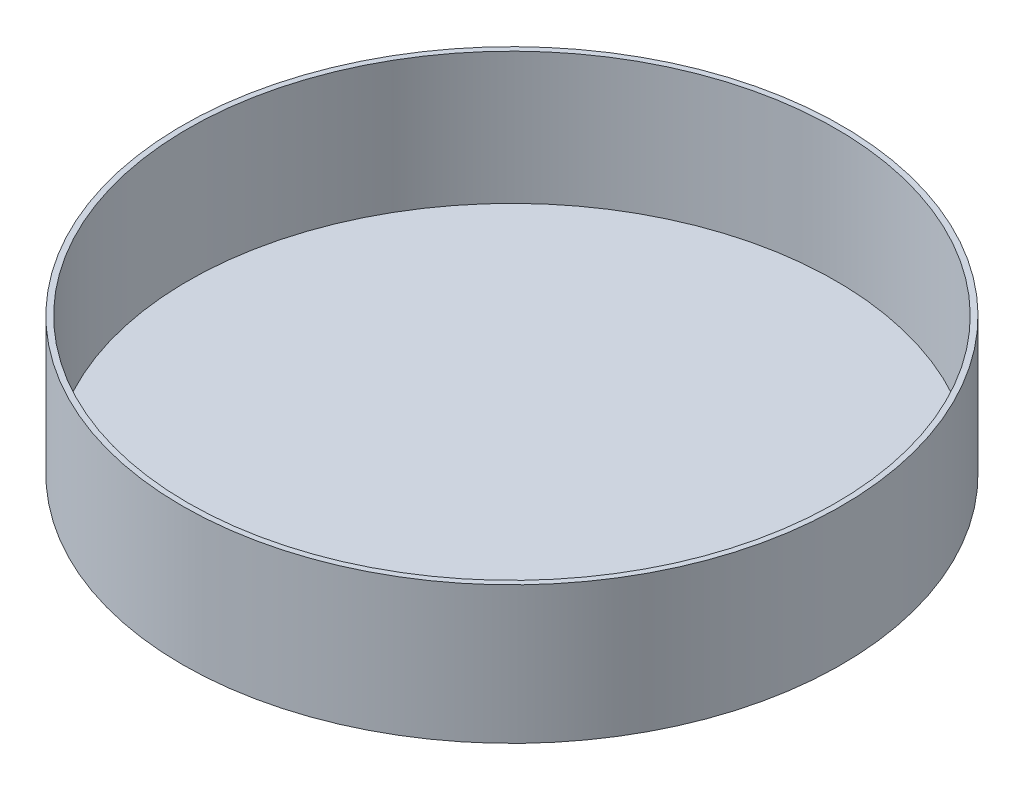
ISO-10303-21;
HEADER;
FILE_DESCRIPTION(('STEP AP214'),'2;1');
FILE_NAME('part.step','',(''),(''),'','','');
FILE_SCHEMA(('AUTOMOTIVE_DESIGN { 1 0 10303 214 1 1 1 1 }'));
ENDSEC;
DATA;
#1=APPLICATION_CONTEXT('core data for automotive mechanical design processes');
#2=APPLICATION_PROTOCOL_DEFINITION('international standard','automotive_design',2000,#1);
#3=PRODUCT_CONTEXT('',#1,'mechanical');
#4=PRODUCT('Part','Part','',(#3));
#5=PRODUCT_RELATED_PRODUCT_CATEGORY('part','',(#4));
#6=PRODUCT_DEFINITION_FORMATION('','',#4);
#7=PRODUCT_DEFINITION_CONTEXT('part definition',#1,'design');
#8=PRODUCT_DEFINITION('design','',#6,#7);
#9=PRODUCT_DEFINITION_SHAPE('','',#8);
#10=(LENGTH_UNIT() NAMED_UNIT(*) SI_UNIT(.MILLI.,.METRE.));
#11=(NAMED_UNIT(*) PLANE_ANGLE_UNIT() SI_UNIT($,.RADIAN.));
#12=(NAMED_UNIT(*) SI_UNIT($,.STERADIAN.) SOLID_ANGLE_UNIT());
#13=UNCERTAINTY_MEASURE_WITH_UNIT(LENGTH_MEASURE(1.E-05),#10,'distance_accuracy_value','');
#14=(GEOMETRIC_REPRESENTATION_CONTEXT(3) GLOBAL_UNCERTAINTY_ASSIGNED_CONTEXT((#13)) GLOBAL_UNIT_ASSIGNED_CONTEXT((#10,
#11,#12)) REPRESENTATION_CONTEXT('',''));
#15=CARTESIAN_POINT('',(0.,0.,0.));
#16=DIRECTION('',(0.,0.,1.));
#17=DIRECTION('',(1.,0.,0.));
#18=AXIS2_PLACEMENT_3D('',#15,#16,#17);
#19=CARTESIAN_POINT('',(0.,25.,0.));
#20=DIRECTION('',(0.,-1.,0.));
#21=DIRECTION('',(0.,0.,-1.));
#22=AXIS2_PLACEMENT_3D('',#19,#20,#21);
#23=CYLINDRICAL_SURFACE('',#22,60.);
#24=CARTESIAN_POINT('',(0.,25.,0.));
#25=DIRECTION('',(0.,1.,0.));
#26=DIRECTION('',(0.,0.,1.));
#27=AXIS2_PLACEMENT_3D('',#24,#25,#26);
#28=CIRCLE('',#27,60.);
#29=CARTESIAN_POINT('',(0.,25.,60.));
#30=VERTEX_POINT('',#29);
#31=EDGE_CURVE('E10',#30,#30,#28,.T.);
#32=ORIENTED_EDGE('',*,*,#31,.F.);
#33=EDGE_LOOP('',(#32));
#34=FACE_BOUND('',#33,.T.);
#35=CARTESIAN_POINT('',(0.,0.,0.));
#36=DIRECTION('',(0.,1.,0.));
#37=DIRECTION('',(0.,0.,1.));
#38=AXIS2_PLACEMENT_3D('',#35,#36,#37);
#39=CIRCLE('',#38,60.);
#40=CARTESIAN_POINT('',(0.,0.,60.));
#41=VERTEX_POINT('',#40);
#42=EDGE_CURVE('E44',#41,#41,#39,.T.);
#43=ORIENTED_EDGE('',*,*,#42,.T.);
#44=EDGE_LOOP('',(#43));
#45=FACE_BOUND('',#44,.T.);
#46=ADVANCED_FACE('F41',(#34,#45),#23,.T.);
#47=CARTESIAN_POINT('',(0.,25.,0.));
#48=DIRECTION('',(0.,1.,0.));
#49=DIRECTION('',(0.,0.,1.));
#50=AXIS2_PLACEMENT_3D('',#47,#48,#49);
#51=PLANE('',#50);
#52=CARTESIAN_POINT('',(0.,25.,0.));
#53=DIRECTION('',(0.,1.,0.));
#54=DIRECTION('',(0.,0.,1.));
#55=AXIS2_PLACEMENT_3D('',#52,#53,#54);
#56=CIRCLE('',#55,59.);
#57=CARTESIAN_POINT('',(0.,25.,59.));
#58=VERTEX_POINT('',#57);
#59=EDGE_CURVE('E55',#58,#58,#56,.T.);
#60=ORIENTED_EDGE('',*,*,#59,.F.);
#61=EDGE_LOOP('',(#60));
#62=FACE_BOUND('',#61,.T.);
#63=ORIENTED_EDGE('',*,*,#31,.T.);
#64=EDGE_LOOP('',(#63));
#65=FACE_BOUND('',#64,.T.);
#66=ADVANCED_FACE('F72',(#62,#65),#51,.T.);
#67=CARTESIAN_POINT('',(0.,0.,0.));
#68=DIRECTION('',(0.,1.,0.));
#69=DIRECTION('',(0.,0.,1.));
#70=AXIS2_PLACEMENT_3D('',#67,#68,#69);
#71=PLANE('',#70);
#72=ORIENTED_EDGE('',*,*,#42,.F.);
#73=EDGE_LOOP('',(#72));
#74=FACE_BOUND('',#73,.T.);
#75=ADVANCED_FACE('F68',(#74),#71,.F.);
#76=CARTESIAN_POINT('',(0.,1.,0.));
#77=DIRECTION('',(0.,1.,0.));
#78=DIRECTION('',(0.,0.,1.));
#79=AXIS2_PLACEMENT_3D('',#76,#77,#78);
#80=CYLINDRICAL_SURFACE('',#79,59.);
#81=CARTESIAN_POINT('',(0.,1.,0.));
#82=DIRECTION('',(0.,1.,0.));
#83=DIRECTION('',(0.,0.,1.));
#84=AXIS2_PLACEMENT_3D('',#81,#82,#83);
#85=CIRCLE('',#84,59.);
#86=CARTESIAN_POINT('',(0.,1.,59.));
#87=VERTEX_POINT('',#86);
#88=EDGE_CURVE('E53',#87,#87,#85,.T.);
#89=ORIENTED_EDGE('',*,*,#88,.F.);
#90=EDGE_LOOP('',(#89));
#91=FACE_BOUND('',#90,.T.);
#92=ORIENTED_EDGE('',*,*,#59,.T.);
#93=EDGE_LOOP('',(#92));
#94=FACE_BOUND('',#93,.T.);
#95=ADVANCED_FACE('F65',(#91,#94),#80,.F.);
#96=CARTESIAN_POINT('',(0.,1.,0.));
#97=DIRECTION('',(0.,1.,0.));
#98=DIRECTION('',(0.,0.,1.));
#99=AXIS2_PLACEMENT_3D('',#96,#97,#98);
#100=PLANE('',#99);
#101=ORIENTED_EDGE('',*,*,#88,.T.);
#102=EDGE_LOOP('',(#101));
#103=FACE_BOUND('',#102,.T.);
#104=ADVANCED_FACE('F63',(#103),#100,.T.);
#105=CLOSED_SHELL('',(#46,#66,#75,#95,#104));
#106=MANIFOLD_SOLID_BREP('B2',#105);
#107=ADVANCED_BREP_SHAPE_REPRESENTATION('',(#18,#106),#14);
#108=SHAPE_DEFINITION_REPRESENTATION(#9,#107);
ENDSEC;
END-ISO-10303-21;
